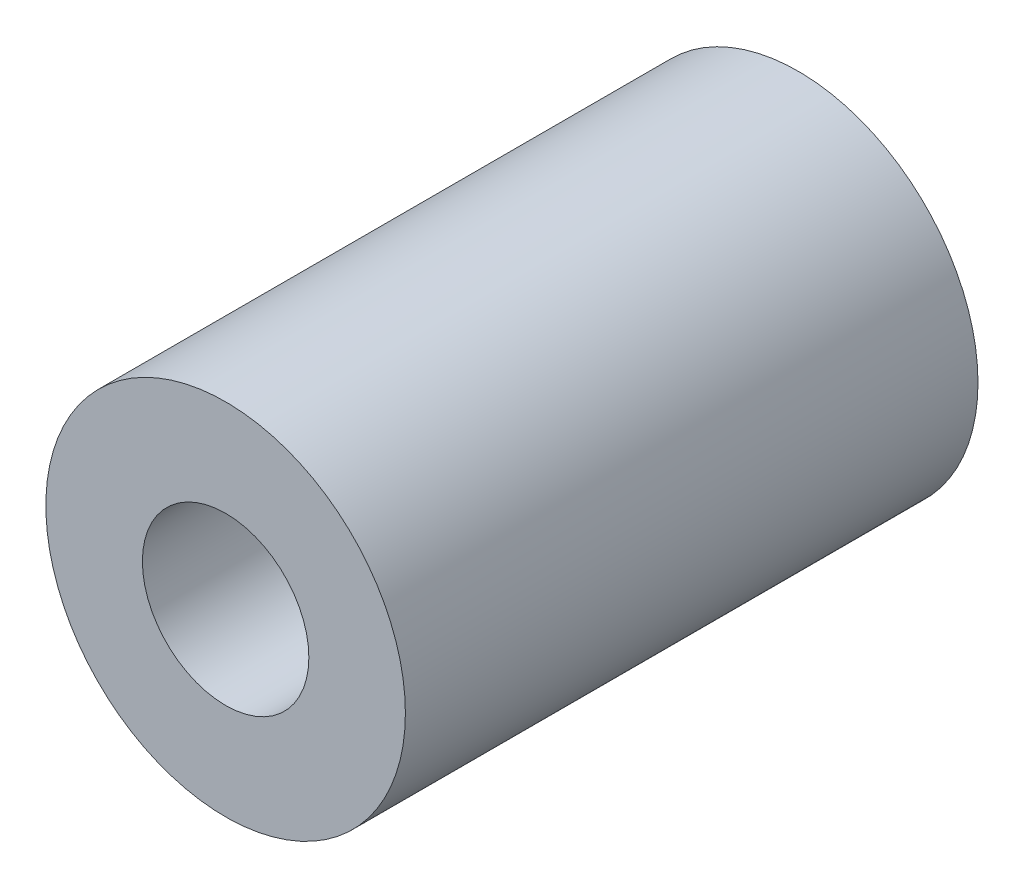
ISO-10303-21;
HEADER;
FILE_DESCRIPTION(('STEP AP214'),'2;1');
FILE_NAME('part.step','',(''),(''),'','','');
FILE_SCHEMA(('AUTOMOTIVE_DESIGN { 1 0 10303 214 1 1 1 1 }'));
ENDSEC;
DATA;
#1=APPLICATION_CONTEXT('core data for automotive mechanical design processes');
#2=APPLICATION_PROTOCOL_DEFINITION('international standard','automotive_design',2000,#1);
#3=PRODUCT_CONTEXT('',#1,'mechanical');
#4=PRODUCT('Part','Part','',(#3));
#5=PRODUCT_RELATED_PRODUCT_CATEGORY('part','',(#4));
#6=PRODUCT_DEFINITION_FORMATION('','',#4);
#7=PRODUCT_DEFINITION_CONTEXT('part definition',#1,'design');
#8=PRODUCT_DEFINITION('design','',#6,#7);
#9=PRODUCT_DEFINITION_SHAPE('','',#8);
#10=(LENGTH_UNIT() NAMED_UNIT(*) SI_UNIT(.MILLI.,.METRE.));
#11=(NAMED_UNIT(*) PLANE_ANGLE_UNIT() SI_UNIT($,.RADIAN.));
#12=(NAMED_UNIT(*) SI_UNIT($,.STERADIAN.) SOLID_ANGLE_UNIT());
#13=UNCERTAINTY_MEASURE_WITH_UNIT(LENGTH_MEASURE(1.E-05),#10,'distance_accuracy_value','');
#14=(GEOMETRIC_REPRESENTATION_CONTEXT(3) GLOBAL_UNCERTAINTY_ASSIGNED_CONTEXT((#13)) GLOBAL_UNIT_ASSIGNED_CONTEXT((#10,
#11,#12)) REPRESENTATION_CONTEXT('',''));
#15=CARTESIAN_POINT('',(0.,0.,0.));
#16=DIRECTION('',(0.,0.,1.));
#17=DIRECTION('',(1.,0.,0.));
#18=AXIS2_PLACEMENT_3D('',#15,#16,#17);
#19=CARTESIAN_POINT('',(0.,0.,43.688));
#20=DIRECTION('',(0.,0.,-1.));
#21=DIRECTION('',(-1.,0.,0.));
#22=AXIS2_PLACEMENT_3D('',#19,#20,#21);
#23=CYLINDRICAL_SURFACE('',#22,13.716);
#24=CARTESIAN_POINT('',(0.,0.,43.688));
#25=DIRECTION('',(0.,0.,1.));
#26=DIRECTION('',(1.,0.,0.));
#27=AXIS2_PLACEMENT_3D('',#24,#25,#26);
#28=CIRCLE('',#27,13.716);
#29=CARTESIAN_POINT('',(13.716,0.,43.688));
#30=VERTEX_POINT('',#29);
#31=EDGE_CURVE('E10',#30,#30,#28,.T.);
#32=ORIENTED_EDGE('',*,*,#31,.F.);
#33=EDGE_LOOP('',(#32));
#34=FACE_BOUND('',#33,.T.);
#35=CARTESIAN_POINT('',(0.,0.,0.));
#36=DIRECTION('',(0.,0.,1.));
#37=DIRECTION('',(1.,0.,0.));
#38=AXIS2_PLACEMENT_3D('',#35,#36,#37);
#39=CIRCLE('',#38,13.716);
#40=CARTESIAN_POINT('',(13.716,0.,0.));
#41=VERTEX_POINT('',#40);
#42=EDGE_CURVE('E36',#41,#41,#39,.T.);
#43=ORIENTED_EDGE('',*,*,#42,.T.);
#44=EDGE_LOOP('',(#43));
#45=FACE_BOUND('',#44,.T.);
#46=ADVANCED_FACE('F30',(#34,#45),#23,.T.);
#47=CARTESIAN_POINT('',(0.,0.,43.688));
#48=DIRECTION('',(0.,0.,1.));
#49=DIRECTION('',(1.,0.,0.));
#50=AXIS2_PLACEMENT_3D('',#47,#48,#49);
#51=PLANE('',#50);
#52=CARTESIAN_POINT('',(0.,0.,43.688));
#53=DIRECTION('',(0.,0.,1.));
#54=DIRECTION('',(1.,0.,0.));
#55=AXIS2_PLACEMENT_3D('',#52,#53,#54);
#56=CIRCLE('',#55,6.35);
#57=CARTESIAN_POINT('',(6.35,0.,43.688));
#58=VERTEX_POINT('',#57);
#59=EDGE_CURVE('E44',#58,#58,#56,.T.);
#60=ORIENTED_EDGE('',*,*,#59,.F.);
#61=EDGE_LOOP('',(#60));
#62=FACE_BOUND('',#61,.T.);
#63=ORIENTED_EDGE('',*,*,#31,.T.);
#64=EDGE_LOOP('',(#63));
#65=FACE_BOUND('',#64,.T.);
#66=ADVANCED_FACE('F62',(#62,#65),#51,.T.);
#67=CARTESIAN_POINT('',(0.,0.,0.));
#68=DIRECTION('',(0.,0.,1.));
#69=DIRECTION('',(1.,0.,0.));
#70=AXIS2_PLACEMENT_3D('',#67,#68,#69);
#71=PLANE('',#70);
#72=CARTESIAN_POINT('',(0.,0.,0.));
#73=DIRECTION('',(0.,0.,-1.));
#74=DIRECTION('',(-1.,0.,0.));
#75=AXIS2_PLACEMENT_3D('',#72,#73,#74);
#76=CIRCLE('',#75,4.7625);
#77=CARTESIAN_POINT('',(-4.7625,0.,0.));
#78=VERTEX_POINT('',#77);
#79=EDGE_CURVE('E52',#78,#78,#76,.T.);
#80=ORIENTED_EDGE('',*,*,#79,.F.);
#81=EDGE_LOOP('',(#80));
#82=FACE_BOUND('',#81,.T.);
#83=ORIENTED_EDGE('',*,*,#42,.F.);
#84=EDGE_LOOP('',(#83));
#85=FACE_BOUND('',#84,.T.);
#86=ADVANCED_FACE('F58',(#82,#85),#71,.F.);
#87=CARTESIAN_POINT('',(0.,0.,24.638));
#88=DIRECTION('',(0.,0.,1.));
#89=DIRECTION('',(1.,0.,0.));
#90=AXIS2_PLACEMENT_3D('',#87,#88,#89);
#91=CYLINDRICAL_SURFACE('',#90,6.35);
#92=CARTESIAN_POINT('',(0.,0.,24.638));
#93=DIRECTION('',(0.,0.,1.));
#94=DIRECTION('',(1.,0.,0.));
#95=AXIS2_PLACEMENT_3D('',#92,#93,#94);
#96=CIRCLE('',#95,6.35);
#97=CARTESIAN_POINT('',(6.35,0.,24.638));
#98=VERTEX_POINT('',#97);
#99=EDGE_CURVE('E40',#98,#98,#96,.T.);
#100=CARTESIAN_POINT('',(6.35,0.,24.638));
#101=CARTESIAN_POINT('',(6.35,0.,24.8364375));
#102=CARTESIAN_POINT('',(6.35,0.,25.034875));
#103=CARTESIAN_POINT('',(6.35,0.,25.43175));
#104=CARTESIAN_POINT('',(6.35,0.,25.6301875));
#105=CARTESIAN_POINT('',(6.35,0.,26.0270625));
#106=CARTESIAN_POINT('',(6.35,0.,26.2255));
#107=CARTESIAN_POINT('',(6.35,0.,26.622375));
#108=CARTESIAN_POINT('',(6.35,0.,26.8208125));
#109=CARTESIAN_POINT('',(6.35,0.,27.2176875));
#110=CARTESIAN_POINT('',(6.35,0.,27.416125));
#111=CARTESIAN_POINT('',(6.35,0.,27.813));
#112=CARTESIAN_POINT('',(6.35,0.,28.0114375));
#113=CARTESIAN_POINT('',(6.35,0.,28.4083125));
#114=CARTESIAN_POINT('',(6.35,0.,28.60675));
#115=CARTESIAN_POINT('',(6.35,0.,29.003625));
#116=CARTESIAN_POINT('',(6.35,0.,29.2020625));
#117=CARTESIAN_POINT('',(6.35,0.,29.5989375));
#118=CARTESIAN_POINT('',(6.35,0.,29.797375));
#119=CARTESIAN_POINT('',(6.35,0.,30.19425));
#120=CARTESIAN_POINT('',(6.35,0.,30.3926875));
#121=CARTESIAN_POINT('',(6.35,0.,30.7895625));
#122=CARTESIAN_POINT('',(6.35,0.,30.988));
#123=CARTESIAN_POINT('',(6.35,0.,31.384875));
#124=CARTESIAN_POINT('',(6.35,0.,31.5833125));
#125=CARTESIAN_POINT('',(6.35,0.,31.9801875));
#126=CARTESIAN_POINT('',(6.35,0.,32.178625));
#127=CARTESIAN_POINT('',(6.35,0.,32.5755));
#128=CARTESIAN_POINT('',(6.35,0.,32.7739375));
#129=CARTESIAN_POINT('',(6.35,0.,33.1708125));
#130=CARTESIAN_POINT('',(6.35,0.,33.36925));
#131=CARTESIAN_POINT('',(6.35,0.,33.766125));
#132=CARTESIAN_POINT('',(6.35,0.,33.9645625));
#133=CARTESIAN_POINT('',(6.35,0.,34.3614375));
#134=CARTESIAN_POINT('',(6.35,0.,34.559875));
#135=CARTESIAN_POINT('',(6.35,0.,34.95675));
#136=CARTESIAN_POINT('',(6.35,0.,35.1551875));
#137=CARTESIAN_POINT('',(6.35,0.,35.5520625));
#138=CARTESIAN_POINT('',(6.35,0.,35.7505));
#139=CARTESIAN_POINT('',(6.35,0.,36.147375));
#140=CARTESIAN_POINT('',(6.35,0.,36.3458125));
#141=CARTESIAN_POINT('',(6.35,0.,36.7426875));
#142=CARTESIAN_POINT('',(6.35,0.,36.941125));
#143=CARTESIAN_POINT('',(6.35,0.,37.338));
#144=CARTESIAN_POINT('',(6.35,0.,37.5364375));
#145=CARTESIAN_POINT('',(6.35,0.,37.9333125));
#146=CARTESIAN_POINT('',(6.35,0.,38.13175));
#147=CARTESIAN_POINT('',(6.35,0.,38.528625));
#148=CARTESIAN_POINT('',(6.35,0.,38.7270625));
#149=CARTESIAN_POINT('',(6.35,0.,39.1239375));
#150=CARTESIAN_POINT('',(6.35,0.,39.322375));
#151=CARTESIAN_POINT('',(6.35,0.,39.71925));
#152=CARTESIAN_POINT('',(6.35,0.,39.9176875));
#153=CARTESIAN_POINT('',(6.35,0.,40.3145625));
#154=CARTESIAN_POINT('',(6.35,0.,40.513));
#155=CARTESIAN_POINT('',(6.35,0.,40.909875));
#156=CARTESIAN_POINT('',(6.35,0.,41.1083125));
#157=CARTESIAN_POINT('',(6.35,0.,41.5051875));
#158=CARTESIAN_POINT('',(6.35,0.,41.703625));
#159=CARTESIAN_POINT('',(6.35,0.,42.1005));
#160=CARTESIAN_POINT('',(6.35,0.,42.2989375));
#161=CARTESIAN_POINT('',(6.35,0.,42.6958125));
#162=CARTESIAN_POINT('',(6.35,0.,42.89425));
#163=CARTESIAN_POINT('',(6.35,0.,43.291125));
#164=CARTESIAN_POINT('',(6.35,0.,43.4895625));
#165=CARTESIAN_POINT('',(6.35,0.,43.688));
#166=B_SPLINE_CURVE_WITH_KNOTS('',3,(#100,#101,#102,#103,#104,#105,#106,#107,#108,#109,#110,
#111,#112,#113,#114,#115,#116,#117,#118,#119,#120,#121,#122,#123,#124,#125,#126,#127,#128,#129,
#130,#131,#132,#133,#134,#135,#136,#137,#138,#139,#140,#141,#142,#143,#144,#145,#146,#147,#148,
#149,#150,#151,#152,#153,#154,#155,#156,#157,#158,#159,#160,#161,#162,#163,#164,#165),
.UNSPECIFIED.,.F.,.F.,(4,2,2,2,2,2,2,2,2,2,2,2,2,2,2,2,2,2,2,2,2,2,2,2,2,2,2,2,2,2,2,2,4),(0.,
0.595312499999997,1.190625,1.7859375,2.38125,2.9765625,3.571875,4.1671875,4.7625,5.3578125,
5.953125,6.5484375,7.14375,7.7390625,8.334375,8.9296875,9.525,10.1203125,10.715625,11.3109375,
11.90625,12.5015625,13.096875,13.6921875,14.2875,14.8828125,15.478125,16.0734375,16.66875,
17.2640625,17.859375,18.4546875,19.05),.UNSPECIFIED.);
#167=EDGE_CURVE('BSEAM61',#98,#58,#166,.T.);
#168=ORIENTED_EDGE('',*,*,#99,.F.);
#169=ORIENTED_EDGE('',*,*,#59,.T.);
#170=ORIENTED_EDGE('',*,*,#167,.T.);
#171=ORIENTED_EDGE('',*,*,#167,.F.);
#172=EDGE_LOOP('',(#168,#170,#169,#171));
#173=FACE_BOUND('',#172,.T.);
#174=ADVANCED_FACE('F61',(#173),#91,.F.);
#175=CARTESIAN_POINT('',(0.,0.,24.638));
#176=DIRECTION('',(0.,0.,1.));
#177=DIRECTION('',(1.,0.,0.));
#178=AXIS2_PLACEMENT_3D('',#175,#176,#177);
#179=PLANE('',#178);
#180=ORIENTED_EDGE('',*,*,#99,.T.);
#181=EDGE_LOOP('',(#180));
#182=FACE_BOUND('',#181,.T.);
#183=ADVANCED_FACE('F68',(#182),#179,.T.);
#184=CARTESIAN_POINT('',(0.,0.,19.05));
#185=DIRECTION('',(0.,0.,-1.));
#186=DIRECTION('',(-1.,0.,0.));
#187=AXIS2_PLACEMENT_3D('',#184,#185,#186);
#188=CYLINDRICAL_SURFACE('',#187,4.7625);
#189=CARTESIAN_POINT('',(0.,0.,19.05));
#190=DIRECTION('',(0.,0.,-1.));
#191=DIRECTION('',(-1.,0.,0.));
#192=AXIS2_PLACEMENT_3D('',#189,#190,#191);
#193=CIRCLE('',#192,4.7625);
#194=CARTESIAN_POINT('',(-4.7625,0.,19.05));
#195=VERTEX_POINT('',#194);
#196=EDGE_CURVE('E49',#195,#195,#193,.T.);
#197=CARTESIAN_POINT('',(-4.7625,0.,19.05));
#198=CARTESIAN_POINT('',(-4.7625,0.,18.8515625));
#199=CARTESIAN_POINT('',(-4.7625,0.,18.653125));
#200=CARTESIAN_POINT('',(-4.7625,0.,18.25625));
#201=CARTESIAN_POINT('',(-4.7625,0.,18.0578125));
#202=CARTESIAN_POINT('',(-4.7625,0.,17.6609375));
#203=CARTESIAN_POINT('',(-4.7625,0.,17.4625));
#204=CARTESIAN_POINT('',(-4.7625,0.,17.065625));
#205=CARTESIAN_POINT('',(-4.7625,0.,16.8671875));
#206=CARTESIAN_POINT('',(-4.7625,0.,16.4703125));
#207=CARTESIAN_POINT('',(-4.7625,0.,16.271875));
#208=CARTESIAN_POINT('',(-4.7625,0.,15.875));
#209=CARTESIAN_POINT('',(-4.7625,0.,15.6765625));
#210=CARTESIAN_POINT('',(-4.7625,0.,15.2796875));
#211=CARTESIAN_POINT('',(-4.7625,0.,15.08125));
#212=CARTESIAN_POINT('',(-4.7625,0.,14.684375));
#213=CARTESIAN_POINT('',(-4.7625,0.,14.4859375));
#214=CARTESIAN_POINT('',(-4.7625,0.,14.0890625));
#215=CARTESIAN_POINT('',(-4.7625,0.,13.890625));
#216=CARTESIAN_POINT('',(-4.7625,0.,13.49375));
#217=CARTESIAN_POINT('',(-4.7625,0.,13.2953125));
#218=CARTESIAN_POINT('',(-4.7625,0.,12.8984375));
#219=CARTESIAN_POINT('',(-4.7625,0.,12.7));
#220=CARTESIAN_POINT('',(-4.7625,0.,12.303125));
#221=CARTESIAN_POINT('',(-4.7625,0.,12.1046875));
#222=CARTESIAN_POINT('',(-4.7625,0.,11.7078125));
#223=CARTESIAN_POINT('',(-4.7625,0.,11.509375));
#224=CARTESIAN_POINT('',(-4.7625,0.,11.1125));
#225=CARTESIAN_POINT('',(-4.7625,0.,10.9140625));
#226=CARTESIAN_POINT('',(-4.7625,0.,10.5171875));
#227=CARTESIAN_POINT('',(-4.7625,0.,10.31875));
#228=CARTESIAN_POINT('',(-4.7625,0.,9.921875));
#229=CARTESIAN_POINT('',(-4.7625,0.,9.7234375));
#230=CARTESIAN_POINT('',(-4.7625,0.,9.3265625));
#231=CARTESIAN_POINT('',(-4.7625,0.,9.128125));
#232=CARTESIAN_POINT('',(-4.7625,0.,8.73125));
#233=CARTESIAN_POINT('',(-4.7625,0.,8.5328125));
#234=CARTESIAN_POINT('',(-4.7625,0.,8.1359375));
#235=CARTESIAN_POINT('',(-4.7625,0.,7.9375));
#236=CARTESIAN_POINT('',(-4.7625,0.,7.540625));
#237=CARTESIAN_POINT('',(-4.7625,0.,7.3421875));
#238=CARTESIAN_POINT('',(-4.7625,0.,6.9453125));
#239=CARTESIAN_POINT('',(-4.7625,0.,6.746875));
#240=CARTESIAN_POINT('',(-4.7625,0.,6.35));
#241=CARTESIAN_POINT('',(-4.7625,0.,6.1515625));
#242=CARTESIAN_POINT('',(-4.7625,0.,5.7546875));
#243=CARTESIAN_POINT('',(-4.7625,0.,5.55625));
#244=CARTESIAN_POINT('',(-4.7625,0.,5.159375));
#245=CARTESIAN_POINT('',(-4.7625,0.,4.9609375));
#246=CARTESIAN_POINT('',(-4.7625,0.,4.5640625));
#247=CARTESIAN_POINT('',(-4.7625,0.,4.365625));
#248=CARTESIAN_POINT('',(-4.7625,0.,3.96875));
#249=CARTESIAN_POINT('',(-4.7625,0.,3.7703125));
#250=CARTESIAN_POINT('',(-4.7625,0.,3.3734375));
#251=CARTESIAN_POINT('',(-4.7625,0.,3.175));
#252=CARTESIAN_POINT('',(-4.7625,0.,2.778125));
#253=CARTESIAN_POINT('',(-4.7625,0.,2.5796875));
#254=CARTESIAN_POINT('',(-4.7625,0.,2.1828125));
#255=CARTESIAN_POINT('',(-4.7625,0.,1.984375));
#256=CARTESIAN_POINT('',(-4.7625,0.,1.5875));
#257=CARTESIAN_POINT('',(-4.7625,0.,1.3890625));
#258=CARTESIAN_POINT('',(-4.7625,0.,0.992187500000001));
#259=CARTESIAN_POINT('',(-4.7625,0.,0.793750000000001));
#260=CARTESIAN_POINT('',(-4.7625,0.,0.396875));
#261=CARTESIAN_POINT('',(-4.7625,0.,0.1984375));
#262=CARTESIAN_POINT('',(-4.7625,0.,0.));
#263=B_SPLINE_CURVE_WITH_KNOTS('',3,(#197,#198,#199,#200,#201,#202,#203,#204,#205,#206,#207,
#208,#209,#210,#211,#212,#213,#214,#215,#216,#217,#218,#219,#220,#221,#222,#223,#224,#225,#226,
#227,#228,#229,#230,#231,#232,#233,#234,#235,#236,#237,#238,#239,#240,#241,#242,#243,#244,#245,
#246,#247,#248,#249,#250,#251,#252,#253,#254,#255,#256,#257,#258,#259,#260,#261,#262),
.UNSPECIFIED.,.F.,.F.,(4,2,2,2,2,2,2,2,2,2,2,2,2,2,2,2,2,2,2,2,2,2,2,2,2,2,2,2,2,2,2,2,4),(0.,
0.595312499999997,1.190625,1.7859375,2.38125,2.9765625,3.571875,4.1671875,4.7625,5.3578125,
5.953125,6.5484375,7.14375,7.7390625,8.334375,8.9296875,9.525,10.1203125,10.715625,11.3109375,
11.90625,12.5015625,13.096875,13.6921875,14.2875,14.8828125,15.478125,16.0734375,16.66875,
17.2640625,17.859375,18.4546875,19.05),.UNSPECIFIED.);
#264=EDGE_CURVE('BSEAM56',#195,#78,#263,.T.);
#265=ORIENTED_EDGE('',*,*,#196,.F.);
#266=ORIENTED_EDGE('',*,*,#79,.T.);
#267=ORIENTED_EDGE('',*,*,#264,.T.);
#268=ORIENTED_EDGE('',*,*,#264,.F.);
#269=EDGE_LOOP('',(#265,#267,#266,#268));
#270=FACE_BOUND('',#269,.T.);
#271=ADVANCED_FACE('F56',(#270),#188,.F.);
#272=CARTESIAN_POINT('',(0.,0.,19.05));
#273=DIRECTION('',(0.,0.,-1.));
#274=DIRECTION('',(-1.,0.,0.));
#275=AXIS2_PLACEMENT_3D('',#272,#273,#274);
#276=PLANE('',#275);
#277=ORIENTED_EDGE('',*,*,#196,.T.);
#278=EDGE_LOOP('',(#277));
#279=FACE_BOUND('',#278,.T.);
#280=ADVANCED_FACE('F108',(#279),#276,.T.);
#281=CLOSED_SHELL('',(#46,#66,#86,#174,#183,#271,#280));
#282=MANIFOLD_SOLID_BREP('B2',#281);
#283=ADVANCED_BREP_SHAPE_REPRESENTATION('',(#18,#282),#14);
#284=SHAPE_DEFINITION_REPRESENTATION(#9,#283);
ENDSEC;
END-ISO-10303-21;
